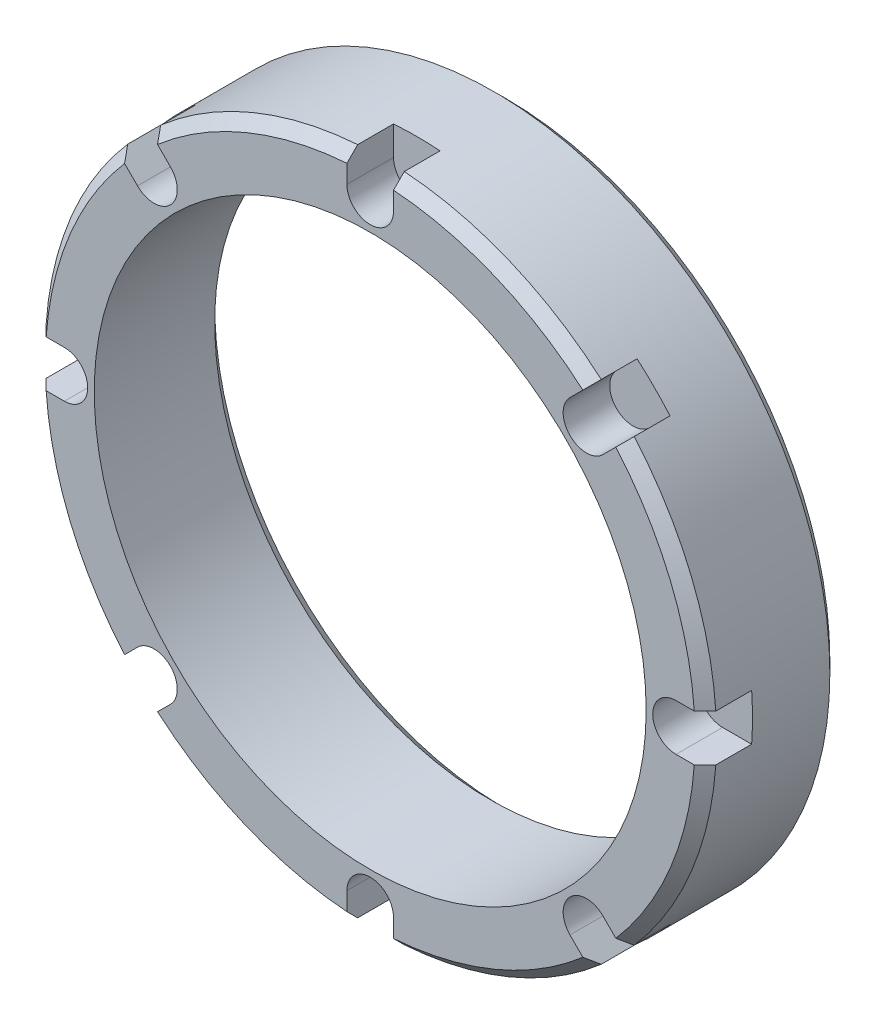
from build123d import *

# Parameters (mm, degrees)
CUT_EXTRUDE1_DEPTH = 1.651
CIRPATTERN1_COUNT  = 8
CHAMFER1_SIZE      = 0.508


with BuildPart() as part:
    # Sketch1 → Revolve1 (revolve)
    with BuildSketch(Plane(origin=(0, 0, 0), x_dir=(0, 0, -1), z_dir=(1, 0, 0)), mode=Mode.PRIVATE) as revolve1_sk:
        Polygon((2.3876, 9.779), (-2.3876, 9.779), (-2.3876, 11.51255), (-2.0066, 11.89355), (2.0066, 11.89355), (2.3876, 11.51255), align=None)
    revolve(revolve1_sk.sketch.rotate(Axis((0, 0, 2.3876), (0, 0, -1)), 90), axis=Axis((0, 0, 2.3876), (0, 0, -1)))

    # Sketch2 → Cut-Extrude1 (cut)
    with BuildSketch(Plane.XY.offset(2.3876)):
        with BuildLine():
            Line((-0.8255, 10.836275), (-0.8255, 11.89355))
            ThreePointArc((-0.8255, 11.89355), (0, 12.71905), (0.8255, 11.89355))
            Line((0.8255, 11.89355), (0.8255, 10.836275))
            ThreePointArc((0.8255, 10.836275), (0, 10.010775), (-0.8255, 10.836275))
        make_face()
    cut_extrude1 = extrude(amount=-CUT_EXTRUDE1_DEPTH, mode=Mode.SUBTRACT)

    # CirPattern1: Cut-Extrude1 ×8 about axis
    cirpattern1_axis = Axis((0, 0, 0), (0, 0, 1))
    for i in range(1, CIRPATTERN1_COUNT):
        add(cut_extrude1.rotate(cirpattern1_axis, i * 360 / CIRPATTERN1_COUNT), mode=Mode.SUBTRACT)

    # Chamfer1
    chamfer1_edges = [part.edges().sort_by_distance(p)[0] for p in [
        (-9.779, 0, -2.3876),
    ]]
    chamfer(chamfer1_edges, length=CHAMFER1_SIZE)


solid = part.part
